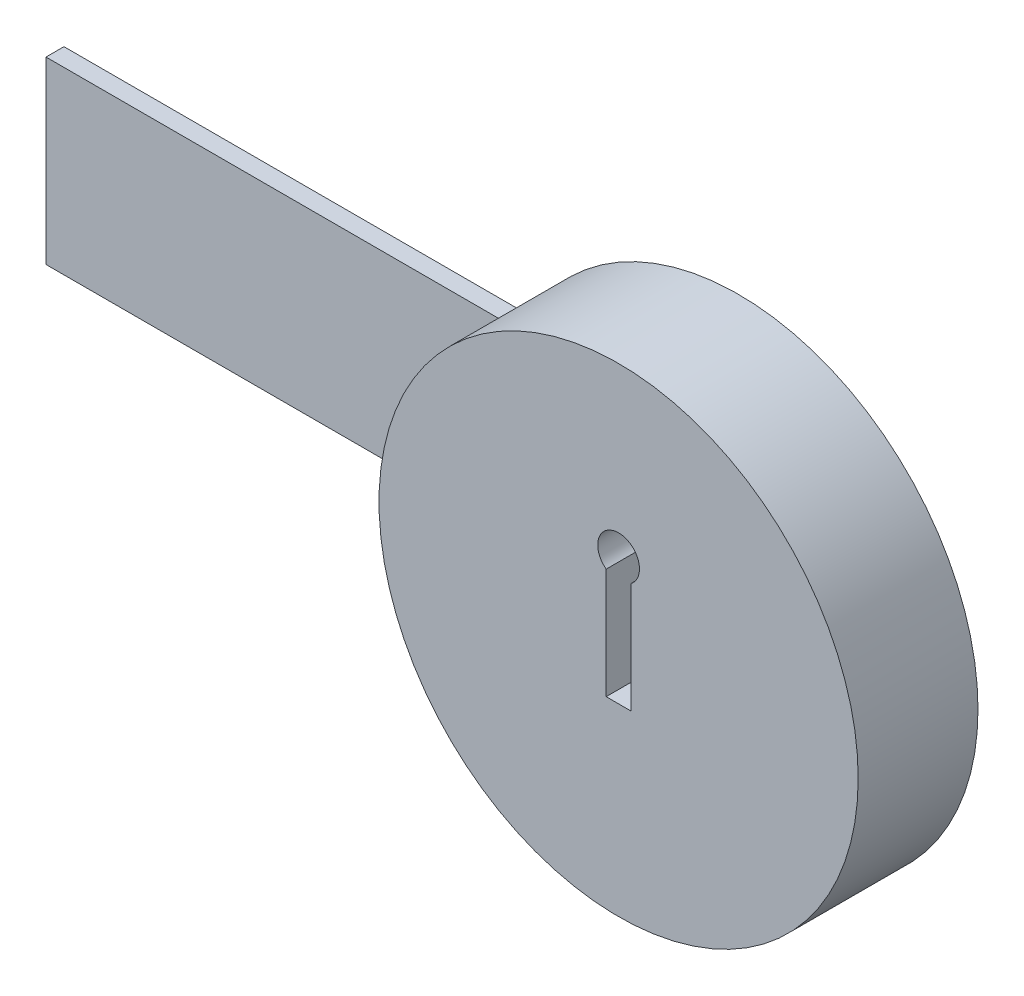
ISO-10303-21;
HEADER;
FILE_DESCRIPTION(('STEP AP214'),'2;1');
FILE_NAME('part.step','',(''),(''),'','','');
FILE_SCHEMA(('AUTOMOTIVE_DESIGN { 1 0 10303 214 1 1 1 1 }'));
ENDSEC;
DATA;
#1=APPLICATION_CONTEXT('core data for automotive mechanical design processes');
#2=APPLICATION_PROTOCOL_DEFINITION('international standard','automotive_design',2000,#1);
#3=PRODUCT_CONTEXT('',#1,'mechanical');
#4=PRODUCT('Part','Part','',(#3));
#5=PRODUCT_RELATED_PRODUCT_CATEGORY('part','',(#4));
#6=PRODUCT_DEFINITION_FORMATION('','',#4);
#7=PRODUCT_DEFINITION_CONTEXT('part definition',#1,'design');
#8=PRODUCT_DEFINITION('design','',#6,#7);
#9=PRODUCT_DEFINITION_SHAPE('','',#8);
#10=(LENGTH_UNIT() NAMED_UNIT(*) SI_UNIT(.MILLI.,.METRE.));
#11=(NAMED_UNIT(*) PLANE_ANGLE_UNIT() SI_UNIT($,.RADIAN.));
#12=(NAMED_UNIT(*) SI_UNIT($,.STERADIAN.) SOLID_ANGLE_UNIT());
#13=UNCERTAINTY_MEASURE_WITH_UNIT(LENGTH_MEASURE(1.E-05),#10,'distance_accuracy_value','');
#14=(GEOMETRIC_REPRESENTATION_CONTEXT(3) GLOBAL_UNCERTAINTY_ASSIGNED_CONTEXT((#13)) GLOBAL_UNIT_ASSIGNED_CONTEXT((#10,
#11,#12)) REPRESENTATION_CONTEXT('',''));
#15=CARTESIAN_POINT('',(0.,0.,0.));
#16=DIRECTION('',(0.,0.,1.));
#17=DIRECTION('',(1.,0.,0.));
#18=AXIS2_PLACEMENT_3D('',#15,#16,#17);
#19=CARTESIAN_POINT('',(0.,0.,0.));
#20=DIRECTION('',(0.,0.,1.));
#21=DIRECTION('',(1.,0.,0.));
#22=AXIS2_PLACEMENT_3D('',#19,#20,#21);
#23=PLANE('',#22);
#24=CARTESIAN_POINT('',(0.,0.,0.));
#25=DIRECTION('',(0.,0.,1.));
#26=DIRECTION('',(1.,0.,0.));
#27=AXIS2_PLACEMENT_3D('',#24,#25,#26);
#28=CIRCLE('',#27,20.);
#29=CARTESIAN_POINT('',(20.,0.,0.));
#30=VERTEX_POINT('',#29);
#31=EDGE_CURVE('E36',#30,#30,#28,.T.);
#32=ORIENTED_EDGE('',*,*,#31,.F.);
#33=EDGE_LOOP('',(#32));
#34=FACE_BOUND('',#33,.T.);
#35=DIRECTION('',(0.,1.,0.));
#36=VECTOR('',#35,1.);
#37=CARTESIAN_POINT('',(-10.7987219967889,6.7498686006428,0.));
#38=LINE('',#37,#36);
#39=CARTESIAN_POINT('',(-10.7987219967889,-8.2501313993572,0.));
#40=VERTEX_POINT('',#39);
#41=CARTESIAN_POINT('',(-10.7987219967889,6.7498686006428,0.));
#42=VERTEX_POINT('',#41);
#43=EDGE_CURVE('E140',#40,#42,#38,.T.);
#44=ORIENTED_EDGE('',*,*,#43,.F.);
#45=DIRECTION('',(-1.,0.,0.));
#46=VECTOR('',#45,1.);
#47=CARTESIAN_POINT('',(-9.29872199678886,-8.2501313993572,0.));
#48=LINE('',#47,#46);
#49=CARTESIAN_POINT('',(-9.29872199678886,-8.2501313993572,0.));
#50=VERTEX_POINT('',#49);
#51=EDGE_CURVE('E144',#50,#40,#48,.T.);
#52=ORIENTED_EDGE('',*,*,#51,.F.);
#53=DIRECTION('',(0.,-1.,0.));
#54=VECTOR('',#53,1.);
#55=CARTESIAN_POINT('',(-9.29872199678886,6.7498686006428,0.));
#56=LINE('',#55,#54);
#57=CARTESIAN_POINT('',(-9.29872199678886,6.7498686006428,0.));
#58=VERTEX_POINT('',#57);
#59=EDGE_CURVE('E151',#58,#50,#56,.T.);
#60=ORIENTED_EDGE('',*,*,#59,.F.);
#61=DIRECTION('',(1.,0.,0.));
#62=VECTOR('',#61,1.);
#63=CARTESIAN_POINT('',(-9.29872199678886,6.7498686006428,0.));
#64=LINE('',#63,#62);
#65=EDGE_CURVE('E149',#42,#58,#64,.T.);
#66=ORIENTED_EDGE('',*,*,#65,.F.);
#67=EDGE_LOOP('',(#44,#52,#60,#66));
#68=FACE_BOUND('',#67,.T.);
#69=ADVANCED_FACE('F32',(#34,#68),#23,.F.);
#70=CARTESIAN_POINT('',(0.,0.,10.));
#71=DIRECTION('',(0.,0.,-1.));
#72=DIRECTION('',(-1.,0.,0.));
#73=AXIS2_PLACEMENT_3D('',#70,#71,#72);
#74=CYLINDRICAL_SURFACE('',#73,20.);
#75=CARTESIAN_POINT('',(0.,0.,10.));
#76=DIRECTION('',(0.,0.,1.));
#77=DIRECTION('',(1.,0.,0.));
#78=AXIS2_PLACEMENT_3D('',#75,#76,#77);
#79=CIRCLE('',#78,20.);
#80=CARTESIAN_POINT('',(20.,0.,10.));
#81=VERTEX_POINT('',#80);
#82=EDGE_CURVE('E11',#81,#81,#79,.T.);
#83=ORIENTED_EDGE('',*,*,#82,.F.);
#84=EDGE_LOOP('',(#83));
#85=FACE_BOUND('',#84,.T.);
#86=ORIENTED_EDGE('',*,*,#31,.T.);
#87=EDGE_LOOP('',(#86));
#88=FACE_BOUND('',#87,.T.);
#89=ADVANCED_FACE('F34',(#85,#88),#74,.T.);
#90=CARTESIAN_POINT('',(0.,0.,10.));
#91=DIRECTION('',(0.,0.,1.));
#92=DIRECTION('',(1.,0.,0.));
#93=AXIS2_PLACEMENT_3D('',#90,#91,#92);
#94=PLANE('',#93);
#95=CARTESIAN_POINT('',(0.,6.01018415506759,10.));
#96=DIRECTION('',(0.,0.,1.));
#97=DIRECTION('',(1.,0.,0.));
#98=AXIS2_PLACEMENT_3D('',#95,#96,#97);
#99=CIRCLE('',#98,1.74235240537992);
#100=CARTESIAN_POINT('',(1.03855552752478,4.61118654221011,10.));
#101=VERTEX_POINT('',#100);
#102=CARTESIAN_POINT('',(-1.03855552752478,4.61118654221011,10.));
#103=VERTEX_POINT('',#102);
#104=EDGE_CURVE('E161',#101,#103,#99,.T.);
#105=ORIENTED_EDGE('',*,*,#104,.F.);
#106=DIRECTION('',(0.,1.,0.));
#107=VECTOR('',#106,1.);
#108=CARTESIAN_POINT('',(1.03855552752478,-4.61118654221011,10.));
#109=LINE('',#108,#107);
#110=CARTESIAN_POINT('',(1.03855552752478,-4.61118654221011,10.));
#111=VERTEX_POINT('',#110);
#112=EDGE_CURVE('E166',#111,#101,#109,.T.);
#113=ORIENTED_EDGE('',*,*,#112,.F.);
#114=DIRECTION('',(1.,0.,0.));
#115=VECTOR('',#114,1.);
#116=CARTESIAN_POINT('',(1.03855552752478,-4.61118654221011,10.));
#117=LINE('',#116,#115);
#118=CARTESIAN_POINT('',(-1.03855552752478,-4.61118654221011,10.));
#119=VERTEX_POINT('',#118);
#120=EDGE_CURVE('E180',#119,#111,#117,.T.);
#121=ORIENTED_EDGE('',*,*,#120,.F.);
#122=DIRECTION('',(0.,-1.,0.));
#123=VECTOR('',#122,1.);
#124=CARTESIAN_POINT('',(-1.03855552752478,-4.61118654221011,10.));
#125=LINE('',#124,#123);
#126=EDGE_CURVE('E177',#103,#119,#125,.T.);
#127=ORIENTED_EDGE('',*,*,#126,.F.);
#128=EDGE_LOOP('',(#105,#113,#121,#127));
#129=FACE_BOUND('',#128,.T.);
#130=ORIENTED_EDGE('',*,*,#82,.T.);
#131=EDGE_LOOP('',(#130));
#132=FACE_BOUND('',#131,.T.);
#133=ADVANCED_FACE('F201',(#129,#132),#94,.T.);
#134=CARTESIAN_POINT('',(0.,6.01018415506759,5.));
#135=DIRECTION('',(0.,0.,1.));
#136=DIRECTION('',(1.,0.,0.));
#137=AXIS2_PLACEMENT_3D('',#134,#135,#136);
#138=CYLINDRICAL_SURFACE('',#137,1.74235240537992);
#139=ORIENTED_EDGE('',*,*,#104,.T.);
#140=DIRECTION('',(0.,0.,1.));
#141=VECTOR('',#140,1.);
#142=CARTESIAN_POINT('',(-1.03855552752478,4.61118654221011,5.));
#143=LINE('',#142,#141);
#144=CARTESIAN_POINT('',(-1.03855552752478,4.61118654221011,5.));
#145=VERTEX_POINT('',#144);
#146=EDGE_CURVE('E175',#145,#103,#143,.T.);
#147=ORIENTED_EDGE('',*,*,#146,.F.);
#148=CARTESIAN_POINT('',(0.,6.01018415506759,5.));
#149=DIRECTION('',(0.,0.,1.));
#150=DIRECTION('',(1.,0.,0.));
#151=AXIS2_PLACEMENT_3D('',#148,#149,#150);
#152=CIRCLE('',#151,1.74235240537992);
#153=CARTESIAN_POINT('',(1.03855552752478,4.61118654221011,5.));
#154=VERTEX_POINT('',#153);
#155=EDGE_CURVE('E162',#154,#145,#152,.T.);
#156=ORIENTED_EDGE('',*,*,#155,.F.);
#157=DIRECTION('',(0.,0.,1.));
#158=VECTOR('',#157,1.);
#159=CARTESIAN_POINT('',(1.03855552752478,4.61118654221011,5.));
#160=LINE('',#159,#158);
#161=EDGE_CURVE('E185',#154,#101,#160,.T.);
#162=ORIENTED_EDGE('',*,*,#161,.T.);
#163=EDGE_LOOP('',(#139,#147,#156,#162));
#164=FACE_BOUND('',#163,.T.);
#165=ADVANCED_FACE('F210',(#164),#138,.F.);
#166=CARTESIAN_POINT('',(1.03855552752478,-4.61118654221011,5.));
#167=DIRECTION('',(1.,0.,0.));
#168=DIRECTION('',(0.,0.,-1.));
#169=AXIS2_PLACEMENT_3D('',#166,#167,#168);
#170=PLANE('',#169);
#171=ORIENTED_EDGE('',*,*,#112,.T.);
#172=ORIENTED_EDGE('',*,*,#161,.F.);
#173=DIRECTION('',(0.,1.,0.));
#174=VECTOR('',#173,1.);
#175=CARTESIAN_POINT('',(1.03855552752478,-4.61118654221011,5.));
#176=LINE('',#175,#174);
#177=CARTESIAN_POINT('',(1.03855552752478,-4.61118654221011,5.));
#178=VERTEX_POINT('',#177);
#179=EDGE_CURVE('E172',#178,#154,#176,.T.);
#180=ORIENTED_EDGE('',*,*,#179,.F.);
#181=DIRECTION('',(0.,0.,1.));
#182=VECTOR('',#181,1.);
#183=CARTESIAN_POINT('',(1.03855552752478,-4.61118654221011,5.));
#184=LINE('',#183,#182);
#185=EDGE_CURVE('E187',#178,#111,#184,.T.);
#186=ORIENTED_EDGE('',*,*,#185,.T.);
#187=EDGE_LOOP('',(#171,#172,#180,#186));
#188=FACE_BOUND('',#187,.T.);
#189=ADVANCED_FACE('F212',(#188),#170,.F.);
#190=CARTESIAN_POINT('',(1.03855552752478,-4.61118654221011,5.));
#191=DIRECTION('',(0.,-1.,0.));
#192=DIRECTION('',(0.,0.,-1.));
#193=AXIS2_PLACEMENT_3D('',#190,#191,#192);
#194=PLANE('',#193);
#195=ORIENTED_EDGE('',*,*,#120,.T.);
#196=ORIENTED_EDGE('',*,*,#185,.F.);
#197=DIRECTION('',(1.,0.,0.));
#198=VECTOR('',#197,1.);
#199=CARTESIAN_POINT('',(1.03855552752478,-4.61118654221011,5.));
#200=LINE('',#199,#198);
#201=CARTESIAN_POINT('',(-1.03855552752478,-4.61118654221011,5.));
#202=VERTEX_POINT('',#201);
#203=EDGE_CURVE('E169',#202,#178,#200,.T.);
#204=ORIENTED_EDGE('',*,*,#203,.F.);
#205=DIRECTION('',(0.,0.,1.));
#206=VECTOR('',#205,1.);
#207=CARTESIAN_POINT('',(-1.03855552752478,-4.61118654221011,5.));
#208=LINE('',#207,#206);
#209=EDGE_CURVE('E189',#202,#119,#208,.T.);
#210=ORIENTED_EDGE('',*,*,#209,.T.);
#211=EDGE_LOOP('',(#195,#196,#204,#210));
#212=FACE_BOUND('',#211,.T.);
#213=ADVANCED_FACE('F205',(#212),#194,.F.);
#214=CARTESIAN_POINT('',(-1.03855552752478,-4.61118654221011,5.));
#215=DIRECTION('',(-1.,0.,0.));
#216=DIRECTION('',(0.,0.,1.));
#217=AXIS2_PLACEMENT_3D('',#214,#215,#216);
#218=PLANE('',#217);
#219=ORIENTED_EDGE('',*,*,#126,.T.);
#220=ORIENTED_EDGE('',*,*,#209,.F.);
#221=DIRECTION('',(0.,-1.,0.));
#222=VECTOR('',#221,1.);
#223=CARTESIAN_POINT('',(-1.03855552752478,-4.61118654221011,5.));
#224=LINE('',#223,#222);
#225=EDGE_CURVE('E165',#145,#202,#224,.T.);
#226=ORIENTED_EDGE('',*,*,#225,.F.);
#227=ORIENTED_EDGE('',*,*,#146,.T.);
#228=EDGE_LOOP('',(#219,#220,#226,#227));
#229=FACE_BOUND('',#228,.T.);
#230=ADVANCED_FACE('F195',(#229),#218,.F.);
#231=CARTESIAN_POINT('',(0.,6.01018415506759,5.));
#232=DIRECTION('',(0.,0.,1.));
#233=DIRECTION('',(1.,0.,0.));
#234=AXIS2_PLACEMENT_3D('',#231,#232,#233);
#235=PLANE('',#234);
#236=ORIENTED_EDGE('',*,*,#155,.T.);
#237=ORIENTED_EDGE('',*,*,#225,.T.);
#238=ORIENTED_EDGE('',*,*,#203,.T.);
#239=ORIENTED_EDGE('',*,*,#179,.T.);
#240=EDGE_LOOP('',(#236,#237,#238,#239));
#241=FACE_BOUND('',#240,.T.);
#242=ADVANCED_FACE('F209',(#241),#235,.T.);
#243=CARTESIAN_POINT('',(-10.7987219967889,6.7498686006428,-3.));
#244=DIRECTION('',(1.,0.,0.));
#245=DIRECTION('',(0.,1.,0.));
#246=AXIS2_PLACEMENT_3D('',#243,#244,#245);
#247=PLANE('',#246);
#248=DIRECTION('',(0.,0.,1.));
#249=VECTOR('',#248,1.);
#250=CARTESIAN_POINT('',(-10.7987219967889,6.7498686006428,-3.));
#251=LINE('',#250,#249);
#252=CARTESIAN_POINT('',(-10.7987219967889,6.7498686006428,-1.5));
#253=VERTEX_POINT('',#252);
#254=EDGE_CURVE('E47',#253,#42,#251,.T.);
#255=ORIENTED_EDGE('',*,*,#254,.F.);
#256=DIRECTION('',(0.,-1.,0.));
#257=VECTOR('',#256,1.);
#258=CARTESIAN_POINT('',(-10.7987219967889,6.7498686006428,-1.5));
#259=LINE('',#258,#257);
#260=CARTESIAN_POINT('',(-10.7987219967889,-8.2501313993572,-1.5));
#261=VERTEX_POINT('',#260);
#262=EDGE_CURVE('E137',#253,#261,#259,.T.);
#263=ORIENTED_EDGE('',*,*,#262,.T.);
#264=DIRECTION('',(0.,0.,1.));
#265=VECTOR('',#264,1.);
#266=CARTESIAN_POINT('',(-10.7987219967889,-8.2501313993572,-3.));
#267=LINE('',#266,#265);
#268=EDGE_CURVE('E116',#261,#40,#267,.T.);
#269=ORIENTED_EDGE('',*,*,#268,.T.);
#270=ORIENTED_EDGE('',*,*,#43,.T.);
#271=EDGE_LOOP('',(#255,#263,#269,#270));
#272=FACE_BOUND('',#271,.T.);
#273=ADVANCED_FACE('F237',(#272),#247,.F.);
#274=CARTESIAN_POINT('',(-9.29872199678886,6.7498686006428,-3.));
#275=DIRECTION('',(0.,-1.,0.));
#276=DIRECTION('',(0.,0.,-1.));
#277=AXIS2_PLACEMENT_3D('',#274,#275,#276);
#278=PLANE('',#277);
#279=ORIENTED_EDGE('',*,*,#65,.T.);
#280=DIRECTION('',(0.,0.,1.));
#281=VECTOR('',#280,1.);
#282=CARTESIAN_POINT('',(-9.29872199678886,6.7498686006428,-3.));
#283=LINE('',#282,#281);
#284=CARTESIAN_POINT('',(-9.29872199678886,6.7498686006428,-3.));
#285=VERTEX_POINT('',#284);
#286=EDGE_CURVE('E158',#285,#58,#283,.T.);
#287=ORIENTED_EDGE('',*,*,#286,.F.);
#288=DIRECTION('',(1.,0.,0.));
#289=VECTOR('',#288,1.);
#290=CARTESIAN_POINT('',(-9.29872199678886,6.7498686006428,-3.));
#291=LINE('',#290,#289);
#292=CARTESIAN_POINT('',(-59.2987219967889,6.74986860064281,-3.));
#293=VERTEX_POINT('',#292);
#294=EDGE_CURVE('E141',#293,#285,#291,.T.);
#295=ORIENTED_EDGE('',*,*,#294,.F.);
#296=DIRECTION('',(0.,0.,1.));
#297=VECTOR('',#296,1.);
#298=CARTESIAN_POINT('',(-59.2987219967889,6.74986860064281,-1.5));
#299=LINE('',#298,#297);
#300=CARTESIAN_POINT('',(-59.2987219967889,6.74986860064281,-1.5));
#301=VERTEX_POINT('',#300);
#302=EDGE_CURVE('E120',#293,#301,#299,.T.);
#303=ORIENTED_EDGE('',*,*,#302,.T.);
#304=DIRECTION('',(1.,0.,0.));
#305=VECTOR('',#304,1.);
#306=CARTESIAN_POINT('',(-59.2987219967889,6.74986860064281,-1.5));
#307=LINE('',#306,#305);
#308=EDGE_CURVE('E119',#301,#253,#307,.T.);
#309=ORIENTED_EDGE('',*,*,#308,.T.);
#310=ORIENTED_EDGE('',*,*,#254,.T.);
#311=EDGE_LOOP('',(#279,#287,#295,#303,#309,#310));
#312=FACE_BOUND('',#311,.T.);
#313=ADVANCED_FACE('F241',(#312),#278,.F.);
#314=CARTESIAN_POINT('',(-9.29872199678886,6.7498686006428,-3.));
#315=DIRECTION('',(-1.,0.,0.));
#316=DIRECTION('',(0.,-1.,0.));
#317=AXIS2_PLACEMENT_3D('',#314,#315,#316);
#318=PLANE('',#317);
#319=ORIENTED_EDGE('',*,*,#59,.T.);
#320=DIRECTION('',(0.,0.,1.));
#321=VECTOR('',#320,1.);
#322=CARTESIAN_POINT('',(-9.29872199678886,-8.2501313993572,-3.));
#323=LINE('',#322,#321);
#324=CARTESIAN_POINT('',(-9.29872199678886,-8.2501313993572,-3.));
#325=VERTEX_POINT('',#324);
#326=EDGE_CURVE('E156',#325,#50,#323,.T.);
#327=ORIENTED_EDGE('',*,*,#326,.F.);
#328=DIRECTION('',(0.,-1.,0.));
#329=VECTOR('',#328,1.);
#330=CARTESIAN_POINT('',(-9.29872199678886,6.7498686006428,-3.));
#331=LINE('',#330,#329);
#332=EDGE_CURVE('E143',#285,#325,#331,.T.);
#333=ORIENTED_EDGE('',*,*,#332,.F.);
#334=ORIENTED_EDGE('',*,*,#286,.T.);
#335=EDGE_LOOP('',(#319,#327,#333,#334));
#336=FACE_BOUND('',#335,.T.);
#337=ADVANCED_FACE('F246',(#336),#318,.F.);
#338=CARTESIAN_POINT('',(-9.29872199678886,-8.2501313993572,-3.));
#339=DIRECTION('',(0.,1.,0.));
#340=DIRECTION('',(0.,0.,1.));
#341=AXIS2_PLACEMENT_3D('',#338,#339,#340);
#342=PLANE('',#341);
#343=ORIENTED_EDGE('',*,*,#268,.F.);
#344=DIRECTION('',(1.,0.,0.));
#345=VECTOR('',#344,1.);
#346=CARTESIAN_POINT('',(-59.2987219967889,-8.2501313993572,-1.5));
#347=LINE('',#346,#345);
#348=CARTESIAN_POINT('',(-59.2987219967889,-8.2501313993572,-1.5));
#349=VERTEX_POINT('',#348);
#350=EDGE_CURVE('E110',#349,#261,#347,.T.);
#351=ORIENTED_EDGE('',*,*,#350,.F.);
#352=DIRECTION('',(0.,0.,-1.));
#353=VECTOR('',#352,1.);
#354=CARTESIAN_POINT('',(-59.2987219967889,-8.2501313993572,-1.5));
#355=LINE('',#354,#353);
#356=CARTESIAN_POINT('',(-59.2987219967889,-8.2501313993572,-3.));
#357=VERTEX_POINT('',#356);
#358=EDGE_CURVE('E114',#349,#357,#355,.T.);
#359=ORIENTED_EDGE('',*,*,#358,.T.);
#360=DIRECTION('',(-1.,0.,0.));
#361=VECTOR('',#360,1.);
#362=CARTESIAN_POINT('',(-9.29872199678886,-8.2501313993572,-3.));
#363=LINE('',#362,#361);
#364=EDGE_CURVE('E146',#325,#357,#363,.T.);
#365=ORIENTED_EDGE('',*,*,#364,.F.);
#366=ORIENTED_EDGE('',*,*,#326,.T.);
#367=ORIENTED_EDGE('',*,*,#51,.T.);
#368=EDGE_LOOP('',(#343,#351,#359,#365,#366,#367));
#369=FACE_BOUND('',#368,.T.);
#370=ADVANCED_FACE('F112',(#369),#342,.F.);
#371=CARTESIAN_POINT('',(0.,0.,-3.));
#372=DIRECTION('',(0.,0.,-1.));
#373=DIRECTION('',(-1.,0.,0.));
#374=AXIS2_PLACEMENT_3D('',#371,#372,#373);
#375=PLANE('',#374);
#376=ORIENTED_EDGE('',*,*,#364,.T.);
#377=DIRECTION('',(0.,1.,0.));
#378=VECTOR('',#377,1.);
#379=CARTESIAN_POINT('',(-59.2987219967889,6.74986860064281,-3.));
#380=LINE('',#379,#378);
#381=EDGE_CURVE('E130',#357,#293,#380,.T.);
#382=ORIENTED_EDGE('',*,*,#381,.T.);
#383=ORIENTED_EDGE('',*,*,#294,.T.);
#384=ORIENTED_EDGE('',*,*,#332,.T.);
#385=EDGE_LOOP('',(#376,#382,#383,#384));
#386=FACE_BOUND('',#385,.T.);
#387=ADVANCED_FACE('F252',(#386),#375,.T.);
#388=CARTESIAN_POINT('',(-59.2987219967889,6.74986860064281,-1.5));
#389=DIRECTION('',(0.,0.,1.));
#390=DIRECTION('',(0.,-1.,0.));
#391=AXIS2_PLACEMENT_3D('',#388,#389,#390);
#392=PLANE('',#391);
#393=ORIENTED_EDGE('',*,*,#262,.F.);
#394=ORIENTED_EDGE('',*,*,#308,.F.);
#395=DIRECTION('',(0.,-1.,0.));
#396=VECTOR('',#395,1.);
#397=CARTESIAN_POINT('',(-59.2987219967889,6.74986860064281,-1.5));
#398=LINE('',#397,#396);
#399=EDGE_CURVE('E127',#301,#349,#398,.T.);
#400=ORIENTED_EDGE('',*,*,#399,.T.);
#401=ORIENTED_EDGE('',*,*,#350,.T.);
#402=EDGE_LOOP('',(#393,#394,#400,#401));
#403=FACE_BOUND('',#402,.T.);
#404=ADVANCED_FACE('F132',(#403),#392,.T.);
#405=CARTESIAN_POINT('',(-59.2987219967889,0.,0.));
#406=DIRECTION('',(1.,0.,0.));
#407=DIRECTION('',(0.,1.,0.));
#408=AXIS2_PLACEMENT_3D('',#405,#406,#407);
#409=PLANE('',#408);
#410=ORIENTED_EDGE('',*,*,#399,.F.);
#411=ORIENTED_EDGE('',*,*,#302,.F.);
#412=ORIENTED_EDGE('',*,*,#381,.F.);
#413=ORIENTED_EDGE('',*,*,#358,.F.);
#414=EDGE_LOOP('',(#410,#411,#412,#413));
#415=FACE_BOUND('',#414,.T.);
#416=ADVANCED_FACE('F125',(#415),#409,.F.);
#417=CLOSED_SHELL('',(#69,#89,#133,#165,#189,#213,#230,#242,#273,#313,#337,#370,#387,#404,#416));
#418=MANIFOLD_SOLID_BREP('B2',#417);
#419=ADVANCED_BREP_SHAPE_REPRESENTATION('',(#18,#418),#14);
#420=SHAPE_DEFINITION_REPRESENTATION(#9,#419);
ENDSEC;
END-ISO-10303-21;
